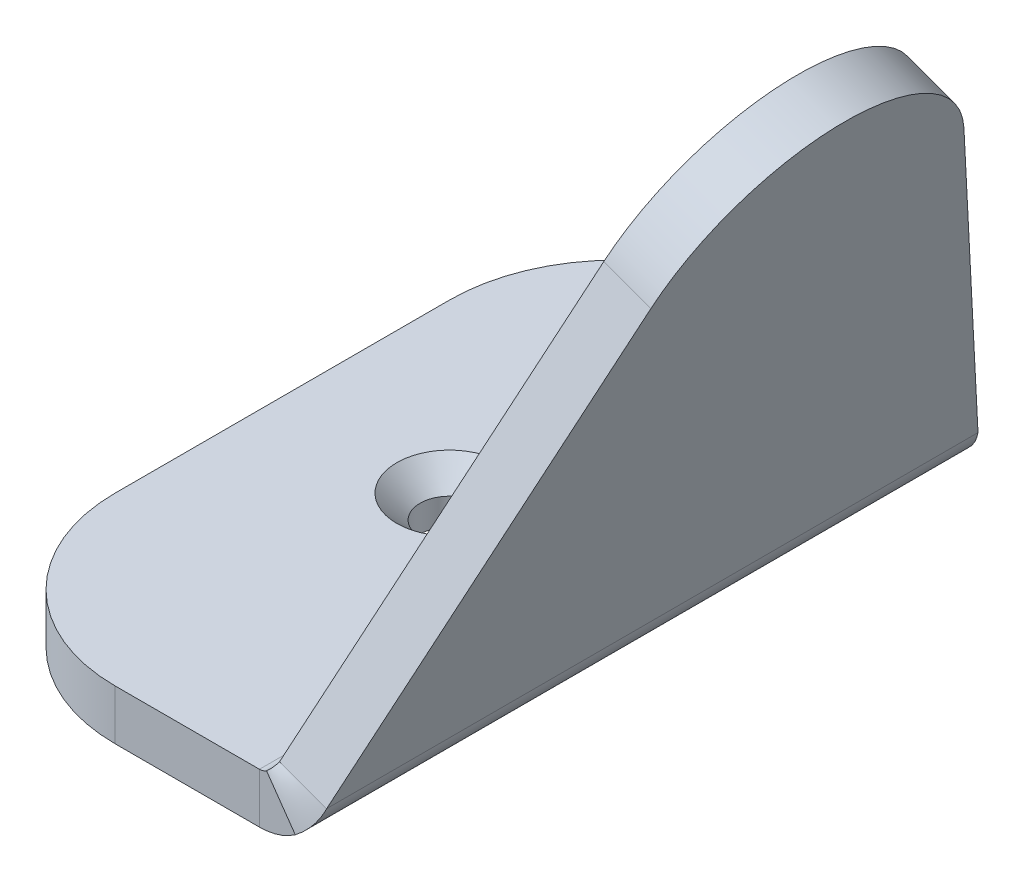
ISO-10303-21;
HEADER;
FILE_DESCRIPTION(('STEP AP214'),'2;1');
FILE_NAME('part.step','',(''),(''),'','','');
FILE_SCHEMA(('AUTOMOTIVE_DESIGN { 1 0 10303 214 1 1 1 1 }'));
ENDSEC;
DATA;
#1=APPLICATION_CONTEXT('core data for automotive mechanical design processes');
#2=APPLICATION_PROTOCOL_DEFINITION('international standard','automotive_design',2000,#1);
#3=PRODUCT_CONTEXT('',#1,'mechanical');
#4=PRODUCT('Part','Part','',(#3));
#5=PRODUCT_RELATED_PRODUCT_CATEGORY('part','',(#4));
#6=PRODUCT_DEFINITION_FORMATION('','',#4);
#7=PRODUCT_DEFINITION_CONTEXT('part definition',#1,'design');
#8=PRODUCT_DEFINITION('design','',#6,#7);
#9=PRODUCT_DEFINITION_SHAPE('','',#8);
#10=(LENGTH_UNIT() NAMED_UNIT(*) SI_UNIT(.MILLI.,.METRE.));
#11=(NAMED_UNIT(*) PLANE_ANGLE_UNIT() SI_UNIT($,.RADIAN.));
#12=(NAMED_UNIT(*) SI_UNIT($,.STERADIAN.) SOLID_ANGLE_UNIT());
#13=UNCERTAINTY_MEASURE_WITH_UNIT(LENGTH_MEASURE(1.E-05),#10,'distance_accuracy_value','');
#14=(GEOMETRIC_REPRESENTATION_CONTEXT(3) GLOBAL_UNCERTAINTY_ASSIGNED_CONTEXT((#13)) GLOBAL_UNIT_ASSIGNED_CONTEXT((#10,
#11,#12)) REPRESENTATION_CONTEXT('',''));
#15=CARTESIAN_POINT('',(0.,0.,0.));
#16=DIRECTION('',(0.,0.,1.));
#17=DIRECTION('',(1.,0.,0.));
#18=AXIS2_PLACEMENT_3D('',#15,#16,#17);
#19=CARTESIAN_POINT('',(8.25750397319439,-11.2221842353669,-10.));
#20=DIRECTION('',(-0.93969262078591,0.342020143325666,0.));
#21=DIRECTION('',(0.,0.,1.));
#22=AXIS2_PLACEMENT_3D('',#19,#20,#21);
#23=PLANE('',#22);
#24=DIRECTION('',(0.320446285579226,0.880418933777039,-0.349537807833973));
#25=VECTOR('',#24,1.);
#26=CARTESIAN_POINT('',(11.6777054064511,-1.82525802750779,20.));
#27=LINE('',#26,#25);
#28=CARTESIAN_POINT('',(12.144994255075,-0.541392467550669,19.4902886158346));
#29=VERTEX_POINT('',#28);
#30=CARTESIAN_POINT('',(21.4236987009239,24.9516384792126,9.36922259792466));
#31=VERTEX_POINT('',#30);
#32=EDGE_CURVE('E109',#29,#31,#27,.T.);
#33=ORIENTED_EDGE('',*,*,#32,.F.);
#34=DIRECTION('',(0.,0.,-1.));
#35=VECTOR('',#34,1.);
#36=CARTESIAN_POINT('',(12.144994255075,-0.541392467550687,-10.));
#37=LINE('',#36,#35);
#38=CARTESIAN_POINT('',(12.1449942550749,-0.541392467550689,-19.4902886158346));
#39=VERTEX_POINT('',#38);
#40=EDGE_CURVE('E100',#29,#39,#37,.T.);
#41=ORIENTED_EDGE('',*,*,#40,.T.);
#42=DIRECTION('',(-0.320446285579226,-0.880418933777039,-0.349537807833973));
#43=VECTOR('',#42,1.);
#44=CARTESIAN_POINT('',(11.6777054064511,-1.82525802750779,-20.));
#45=LINE('',#44,#43);
#46=CARTESIAN_POINT('',(21.4236987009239,24.9516384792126,-9.36922259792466));
#47=VERTEX_POINT('',#46);
#48=EDGE_CURVE('E122',#47,#39,#45,.T.);
#49=ORIENTED_EDGE('',*,*,#48,.F.);
#50=CARTESIAN_POINT('',(20.2282089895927,21.6670574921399,0.));
#51=DIRECTION('',(-0.93969262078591,0.342020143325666,0.));
#52=DIRECTION('',(0.,0.,1.));
#53=AXIS2_PLACEMENT_3D('',#50,#51,#52);
#54=CIRCLE('',#53,10.);
#55=EDGE_CURVE('E99',#31,#47,#54,.T.);
#56=ORIENTED_EDGE('',*,*,#55,.F.);
#57=EDGE_LOOP('',(#33,#41,#49,#56));
#58=FACE_BOUND('',#57,.T.);
#59=ADVANCED_FACE('F54',(#58),#23,.F.);
#60=CARTESIAN_POINT('',(11.6777054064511,-1.82525802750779,-20.));
#61=DIRECTION('',(0.119548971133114,0.328458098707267,-0.936922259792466));
#62=DIRECTION('',(-0.320446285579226,-0.880418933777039,-0.349537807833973));
#63=AXIS2_PLACEMENT_3D('',#60,#61,#62);
#64=PLANE('',#63);
#65=CARTESIAN_POINT('',(9.32591639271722,0.484667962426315,-19.4902886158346));
#66=CARTESIAN_POINT('',(12.1449942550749,-0.54139246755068,-19.4902886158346));
#67=B_SPLINE_CURVE_WITH_KNOTS('',1,(#65,#66),.UNSPECIFIED.,.F.,.F.,(2,2),(0.,1.),.UNSPECIFIED.);
#68=CARTESIAN_POINT('',(9.32591639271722,0.484667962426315,-19.4902886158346));
#69=VERTEX_POINT('',#68);
#70=EDGE_CURVE('E12',#69,#39,#67,.T.);
#71=ORIENTED_EDGE('',*,*,#70,.F.);
#72=DIRECTION('',(-0.320446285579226,-0.880418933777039,-0.349537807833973));
#73=VECTOR('',#72,1.);
#74=CARTESIAN_POINT('',(8.85862754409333,-0.79919759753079,-20.));
#75=LINE('',#74,#73);
#76=CARTESIAN_POINT('',(18.6046208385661,25.9776989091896,-9.36922259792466));
#77=VERTEX_POINT('',#76);
#78=EDGE_CURVE('E105',#77,#69,#75,.T.);
#79=ORIENTED_EDGE('',*,*,#78,.F.);
#80=DIRECTION('',(-0.93969262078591,0.342020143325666,0.));
#81=VECTOR('',#80,1.);
#82=CARTESIAN_POINT('',(21.4236987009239,24.9516384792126,-9.36922259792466));
#83=LINE('',#82,#81);
#84=EDGE_CURVE('E81',#47,#77,#83,.T.);
#85=ORIENTED_EDGE('',*,*,#84,.F.);
#86=ORIENTED_EDGE('',*,*,#48,.T.);
#87=EDGE_LOOP('',(#71,#79,#85,#86));
#88=FACE_BOUND('',#87,.T.);
#89=ADVANCED_FACE('F56',(#88),#64,.T.);
#90=CARTESIAN_POINT('',(20.2282089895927,21.6670574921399,0.));
#91=DIRECTION('',(-0.93969262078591,0.342020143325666,0.));
#92=DIRECTION('',(0.,0.,1.));
#93=AXIS2_PLACEMENT_3D('',#90,#91,#92);
#94=CYLINDRICAL_SURFACE('',#93,10.);
#95=CARTESIAN_POINT('',(17.409131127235,22.693117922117,0.));
#96=DIRECTION('',(-0.93969262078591,0.342020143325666,0.));
#97=DIRECTION('',(0.,0.,1.));
#98=AXIS2_PLACEMENT_3D('',#95,#96,#97);
#99=CIRCLE('',#98,10.);
#100=CARTESIAN_POINT('',(18.6046208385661,25.9776989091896,9.36922259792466));
#101=VERTEX_POINT('',#100);
#102=EDGE_CURVE('E97',#101,#77,#99,.T.);
#103=ORIENTED_EDGE('',*,*,#102,.F.);
#104=DIRECTION('',(-0.93969262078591,0.342020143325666,0.));
#105=VECTOR('',#104,1.);
#106=CARTESIAN_POINT('',(21.4236987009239,24.9516384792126,9.36922259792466));
#107=LINE('',#106,#105);
#108=EDGE_CURVE('E101',#31,#101,#107,.T.);
#109=ORIENTED_EDGE('',*,*,#108,.F.);
#110=ORIENTED_EDGE('',*,*,#55,.T.);
#111=ORIENTED_EDGE('',*,*,#84,.T.);
#112=EDGE_LOOP('',(#103,#109,#110,#111));
#113=FACE_BOUND('',#112,.T.);
#114=ADVANCED_FACE('F94',(#113),#94,.T.);
#115=CARTESIAN_POINT('',(11.6777054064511,-1.82525802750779,20.));
#116=DIRECTION('',(0.119548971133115,0.328458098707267,0.936922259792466));
#117=DIRECTION('',(0.320446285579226,0.880418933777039,-0.349537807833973));
#118=AXIS2_PLACEMENT_3D('',#115,#116,#117);
#119=PLANE('',#118);
#120=CARTESIAN_POINT('',(12.144994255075,-0.541392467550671,19.4902886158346));
#121=CARTESIAN_POINT('',(9.32591639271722,0.484667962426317,19.4902886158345));
#122=B_SPLINE_CURVE_WITH_KNOTS('',1,(#120,#121),.UNSPECIFIED.,.F.,.F.,(2,2),(0.,1.),.UNSPECIFIED.);
#123=CARTESIAN_POINT('',(9.32591639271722,0.484667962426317,19.4902886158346));
#124=VERTEX_POINT('',#123);
#125=EDGE_CURVE('E125',#29,#124,#122,.T.);
#126=ORIENTED_EDGE('',*,*,#125,.F.);
#127=ORIENTED_EDGE('',*,*,#32,.T.);
#128=ORIENTED_EDGE('',*,*,#108,.T.);
#129=DIRECTION('',(0.320446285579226,0.880418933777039,-0.349537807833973));
#130=VECTOR('',#129,1.);
#131=CARTESIAN_POINT('',(8.85862754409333,-0.79919759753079,20.));
#132=LINE('',#131,#130);
#133=EDGE_CURVE('E113',#124,#101,#132,.T.);
#134=ORIENTED_EDGE('',*,*,#133,.F.);
#135=EDGE_LOOP('',(#126,#127,#128,#134));
#136=FACE_BOUND('',#135,.T.);
#137=ADVANCED_FACE('F143',(#136),#119,.T.);
#138=CARTESIAN_POINT('',(5.43842611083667,-10.1961238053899,-10.));
#139=DIRECTION('',(-0.93969262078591,0.342020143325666,0.));
#140=DIRECTION('',(0.,0.,1.));
#141=AXIS2_PLACEMENT_3D('',#138,#139,#140);
#142=PLANE('',#141);
#143=DIRECTION('',(0.,0.,-1.));
#144=VECTOR('',#143,1.);
#145=CARTESIAN_POINT('',(9.32591639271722,0.484667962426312,-10.));
#146=LINE('',#145,#144);
#147=EDGE_CURVE('E65',#124,#69,#146,.T.);
#148=ORIENTED_EDGE('',*,*,#147,.F.);
#149=ORIENTED_EDGE('',*,*,#133,.T.);
#150=ORIENTED_EDGE('',*,*,#102,.T.);
#151=ORIENTED_EDGE('',*,*,#78,.T.);
#152=EDGE_LOOP('',(#148,#149,#150,#151));
#153=FACE_BOUND('',#152,.T.);
#154=ADVANCED_FACE('F111',(#153),#142,.T.);
#155=CARTESIAN_POINT('',(0.,0.,0.));
#156=DIRECTION('',(0.,1.,0.));
#157=DIRECTION('',(0.,0.,1.));
#158=AXIS2_PLACEMENT_3D('',#155,#156,#157);
#159=CONICAL_SURFACE('',#158,3.15,0.785398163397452);
#160=CARTESIAN_POINT('',(0.,-1.4,0.));
#161=DIRECTION('',(0.,1.,0.));
#162=DIRECTION('',(0.,0.,1.));
#163=AXIS2_PLACEMENT_3D('',#160,#161,#162);
#164=CIRCLE('',#163,1.74999999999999);
#165=CARTESIAN_POINT('',(0.,-1.4,1.74999999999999));
#166=VERTEX_POINT('',#165);
#167=EDGE_CURVE('E310',#166,#166,#164,.T.);
#168=ORIENTED_EDGE('',*,*,#167,.F.);
#169=EDGE_LOOP('',(#168));
#170=FACE_BOUND('',#169,.T.);
#171=CARTESIAN_POINT('',(0.,0.,0.));
#172=DIRECTION('',(0.,1.,0.));
#173=DIRECTION('',(0.,0.,1.));
#174=AXIS2_PLACEMENT_3D('',#171,#172,#173);
#175=CIRCLE('',#174,3.15);
#176=CARTESIAN_POINT('',(0.,0.,3.15));
#177=VERTEX_POINT('',#176);
#178=EDGE_CURVE('E307',#177,#177,#175,.T.);
#179=ORIENTED_EDGE('',*,*,#178,.T.);
#180=EDGE_LOOP('',(#179));
#181=FACE_BOUND('',#180,.T.);
#182=ADVANCED_FACE('F154',(#170,#181),#159,.F.);
#183=CARTESIAN_POINT('',(0.,0.,0.));
#184=DIRECTION('',(0.,1.,0.));
#185=DIRECTION('',(0.,0.,1.));
#186=AXIS2_PLACEMENT_3D('',#183,#184,#185);
#187=CYLINDRICAL_SURFACE('',#186,1.74999999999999);
#188=ORIENTED_EDGE('',*,*,#167,.T.);
#189=EDGE_LOOP('',(#188));
#190=FACE_BOUND('',#189,.T.);
#191=CARTESIAN_POINT('',(0.,-3.,0.));
#192=DIRECTION('',(0.,1.,0.));
#193=DIRECTION('',(0.,0.,1.));
#194=AXIS2_PLACEMENT_3D('',#191,#192,#193);
#195=CIRCLE('',#194,1.74999999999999);
#196=CARTESIAN_POINT('',(0.,-3.,1.74999999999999));
#197=VERTEX_POINT('',#196);
#198=EDGE_CURVE('E333',#197,#197,#195,.T.);
#199=ORIENTED_EDGE('',*,*,#198,.F.);
#200=EDGE_LOOP('',(#199));
#201=FACE_BOUND('',#200,.T.);
#202=ADVANCED_FACE('F158',(#190,#201),#187,.F.);
#203=CARTESIAN_POINT('',(0.,-3.,-10.));
#204=DIRECTION('',(0.,1.,0.));
#205=DIRECTION('',(0.,0.,1.));
#206=AXIS2_PLACEMENT_3D('',#203,#204,#205);
#207=CYLINDRICAL_SURFACE('',#206,10.);
#208=CARTESIAN_POINT('',(0.,0.,-10.));
#209=DIRECTION('',(0.,1.,0.));
#210=DIRECTION('',(0.,0.,1.));
#211=AXIS2_PLACEMENT_3D('',#208,#209,#210);
#212=CIRCLE('',#211,10.);
#213=CARTESIAN_POINT('',(0.,0.,-20.));
#214=VERTEX_POINT('',#213);
#215=CARTESIAN_POINT('',(-10.,0.,-10.));
#216=VERTEX_POINT('',#215);
#217=EDGE_CURVE('E351',#214,#216,#212,.T.);
#218=ORIENTED_EDGE('',*,*,#217,.F.);
#219=DIRECTION('',(0.,1.,0.));
#220=VECTOR('',#219,1.);
#221=CARTESIAN_POINT('',(0.,-3.,-20.));
#222=LINE('',#221,#220);
#223=CARTESIAN_POINT('',(0.,-3.,-20.));
#224=VERTEX_POINT('',#223);
#225=EDGE_CURVE('E116',#224,#214,#222,.T.);
#226=ORIENTED_EDGE('',*,*,#225,.F.);
#227=CARTESIAN_POINT('',(0.,-3.,-10.));
#228=DIRECTION('',(0.,1.,0.));
#229=DIRECTION('',(0.,0.,1.));
#230=AXIS2_PLACEMENT_3D('',#227,#228,#229);
#231=CIRCLE('',#230,10.);
#232=CARTESIAN_POINT('',(-10.,-3.,-10.));
#233=VERTEX_POINT('',#232);
#234=EDGE_CURVE('E315',#224,#233,#231,.T.);
#235=ORIENTED_EDGE('',*,*,#234,.T.);
#236=DIRECTION('',(0.,1.,0.));
#237=VECTOR('',#236,1.);
#238=CARTESIAN_POINT('',(-10.,-3.,-10.));
#239=LINE('',#238,#237);
#240=EDGE_CURVE('E318',#233,#216,#239,.T.);
#241=ORIENTED_EDGE('',*,*,#240,.T.);
#242=EDGE_LOOP('',(#218,#226,#235,#241));
#243=FACE_BOUND('',#242,.T.);
#244=ADVANCED_FACE('F443',(#243),#207,.T.);
#245=CARTESIAN_POINT('',(-10.,-3.,-10.));
#246=DIRECTION('',(-1.,0.,0.));
#247=DIRECTION('',(0.,0.,1.));
#248=AXIS2_PLACEMENT_3D('',#245,#246,#247);
#249=PLANE('',#248);
#250=DIRECTION('',(0.,0.,1.));
#251=VECTOR('',#250,1.);
#252=CARTESIAN_POINT('',(-10.,0.,-10.));
#253=LINE('',#252,#251);
#254=CARTESIAN_POINT('',(-10.,0.,10.));
#255=VERTEX_POINT('',#254);
#256=EDGE_CURVE('E354',#216,#255,#253,.T.);
#257=ORIENTED_EDGE('',*,*,#256,.F.);
#258=ORIENTED_EDGE('',*,*,#240,.F.);
#259=DIRECTION('',(0.,0.,1.));
#260=VECTOR('',#259,1.);
#261=CARTESIAN_POINT('',(-10.,-3.,-10.));
#262=LINE('',#261,#260);
#263=CARTESIAN_POINT('',(-10.,-3.,10.));
#264=VERTEX_POINT('',#263);
#265=EDGE_CURVE('E321',#233,#264,#262,.T.);
#266=ORIENTED_EDGE('',*,*,#265,.T.);
#267=DIRECTION('',(0.,1.,0.));
#268=VECTOR('',#267,1.);
#269=CARTESIAN_POINT('',(-10.,-3.,10.));
#270=LINE('',#269,#268);
#271=EDGE_CURVE('E324',#264,#255,#270,.T.);
#272=ORIENTED_EDGE('',*,*,#271,.T.);
#273=EDGE_LOOP('',(#257,#258,#266,#272));
#274=FACE_BOUND('',#273,.T.);
#275=ADVANCED_FACE('F448',(#274),#249,.T.);
#276=CARTESIAN_POINT('',(0.,-3.,10.));
#277=DIRECTION('',(0.,1.,0.));
#278=DIRECTION('',(0.,0.,1.));
#279=AXIS2_PLACEMENT_3D('',#276,#277,#278);
#280=CYLINDRICAL_SURFACE('',#279,10.);
#281=CARTESIAN_POINT('',(0.,0.,10.));
#282=DIRECTION('',(0.,1.,0.));
#283=DIRECTION('',(0.,0.,1.));
#284=AXIS2_PLACEMENT_3D('',#281,#282,#283);
#285=CIRCLE('',#284,10.);
#286=CARTESIAN_POINT('',(0.,0.,20.));
#287=VERTEX_POINT('',#286);
#288=EDGE_CURVE('E357',#255,#287,#285,.T.);
#289=ORIENTED_EDGE('',*,*,#288,.F.);
#290=ORIENTED_EDGE('',*,*,#271,.F.);
#291=CARTESIAN_POINT('',(0.,-3.,10.));
#292=DIRECTION('',(0.,1.,0.));
#293=DIRECTION('',(0.,0.,1.));
#294=AXIS2_PLACEMENT_3D('',#291,#292,#293);
#295=CIRCLE('',#294,10.);
#296=CARTESIAN_POINT('',(0.,-3.,20.));
#297=VERTEX_POINT('',#296);
#298=EDGE_CURVE('E327',#264,#297,#295,.T.);
#299=ORIENTED_EDGE('',*,*,#298,.T.);
#300=DIRECTION('',(0.,1.,0.));
#301=VECTOR('',#300,1.);
#302=CARTESIAN_POINT('',(0.,-3.,20.));
#303=LINE('',#302,#301);
#304=EDGE_CURVE('E330',#297,#287,#303,.T.);
#305=ORIENTED_EDGE('',*,*,#304,.T.);
#306=EDGE_LOOP('',(#289,#290,#299,#305));
#307=FACE_BOUND('',#306,.T.);
#308=ADVANCED_FACE('F462',(#307),#280,.T.);
#309=CARTESIAN_POINT('',(0.,-3.,-10.));
#310=DIRECTION('',(0.,1.,0.));
#311=DIRECTION('',(0.,0.,1.));
#312=AXIS2_PLACEMENT_3D('',#309,#310,#311);
#313=PLANE('',#312);
#314=DIRECTION('',(0.,0.,-1.));
#315=VECTOR('',#314,1.);
#316=CARTESIAN_POINT('',(8.63373880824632,-3.,-10.));
#317=LINE('',#316,#315);
#318=CARTESIAN_POINT('',(8.63373880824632,-3.,20.));
#319=VERTEX_POINT('',#318);
#320=CARTESIAN_POINT('',(8.63373880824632,-3.,-20.));
#321=VERTEX_POINT('',#320);
#322=EDGE_CURVE('E304',#319,#321,#317,.T.);
#323=ORIENTED_EDGE('',*,*,#322,.F.);
#324=DIRECTION('',(1.,0.,0.));
#325=VECTOR('',#324,1.);
#326=CARTESIAN_POINT('',(0.,-3.,20.));
#327=LINE('',#326,#325);
#328=EDGE_CURVE('E336',#297,#319,#327,.T.);
#329=ORIENTED_EDGE('',*,*,#328,.F.);
#330=ORIENTED_EDGE('',*,*,#298,.F.);
#331=ORIENTED_EDGE('',*,*,#265,.F.);
#332=ORIENTED_EDGE('',*,*,#234,.F.);
#333=DIRECTION('',(-1.,0.,0.));
#334=VECTOR('',#333,1.);
#335=CARTESIAN_POINT('',(0.,-3.,-20.));
#336=LINE('',#335,#334);
#337=EDGE_CURVE('E363',#321,#224,#336,.T.);
#338=ORIENTED_EDGE('',*,*,#337,.F.);
#339=EDGE_LOOP('',(#323,#329,#330,#331,#332,#338));
#340=FACE_BOUND('',#339,.T.);
#341=ORIENTED_EDGE('',*,*,#198,.T.);
#342=EDGE_LOOP('',(#341));
#343=FACE_BOUND('',#342,.T.);
#344=ADVANCED_FACE('F457',(#340,#343),#313,.F.);
#345=CARTESIAN_POINT('',(0.,-3.,20.));
#346=DIRECTION('',(0.,0.,1.));
#347=DIRECTION('',(1.,0.,0.));
#348=AXIS2_PLACEMENT_3D('',#345,#346,#347);
#349=PLANE('',#348);
#350=ORIENTED_EDGE('',*,*,#328,.T.);
#351=DIRECTION('',(0.,1.,0.));
#352=VECTOR('',#351,1.);
#353=CARTESIAN_POINT('',(8.63373880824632,-3.,20.));
#354=LINE('',#353,#352);
#355=CARTESIAN_POINT('',(8.63373880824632,0.,20.));
#356=VERTEX_POINT('',#355);
#357=EDGE_CURVE('E339',#319,#356,#354,.T.);
#358=ORIENTED_EDGE('',*,*,#357,.T.);
#359=DIRECTION('',(1.,0.,0.));
#360=VECTOR('',#359,1.);
#361=CARTESIAN_POINT('',(0.,0.,20.));
#362=LINE('',#361,#360);
#363=EDGE_CURVE('E342',#287,#356,#362,.T.);
#364=ORIENTED_EDGE('',*,*,#363,.F.);
#365=ORIENTED_EDGE('',*,*,#304,.F.);
#366=EDGE_LOOP('',(#350,#358,#364,#365));
#367=FACE_BOUND('',#366,.T.);
#368=ADVANCED_FACE('F465',(#367),#349,.T.);
#369=CARTESIAN_POINT('',(0.,0.,-10.));
#370=DIRECTION('',(0.,1.,0.));
#371=DIRECTION('',(0.,0.,1.));
#372=AXIS2_PLACEMENT_3D('',#369,#370,#371);
#373=PLANE('',#372);
#374=ORIENTED_EDGE('',*,*,#178,.F.);
#375=EDGE_LOOP('',(#374));
#376=FACE_BOUND('',#375,.T.);
#377=ORIENTED_EDGE('',*,*,#363,.T.);
#378=DIRECTION('',(0.,0.,-1.));
#379=VECTOR('',#378,1.);
#380=CARTESIAN_POINT('',(8.63373880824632,0.,-10.));
#381=LINE('',#380,#379);
#382=CARTESIAN_POINT('',(8.63373880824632,0.,-20.));
#383=VERTEX_POINT('',#382);
#384=EDGE_CURVE('E345',#356,#383,#381,.T.);
#385=ORIENTED_EDGE('',*,*,#384,.T.);
#386=DIRECTION('',(-1.,0.,0.));
#387=VECTOR('',#386,1.);
#388=CARTESIAN_POINT('',(0.,0.,-20.));
#389=LINE('',#388,#387);
#390=EDGE_CURVE('E348',#383,#214,#389,.T.);
#391=ORIENTED_EDGE('',*,*,#390,.T.);
#392=ORIENTED_EDGE('',*,*,#217,.T.);
#393=ORIENTED_EDGE('',*,*,#256,.T.);
#394=ORIENTED_EDGE('',*,*,#288,.T.);
#395=EDGE_LOOP('',(#377,#385,#391,#392,#393,#394));
#396=FACE_BOUND('',#395,.T.);
#397=ADVANCED_FACE('F451',(#376,#396),#373,.T.);
#398=CARTESIAN_POINT('',(0.,-3.,-20.));
#399=DIRECTION('',(0.,0.,-1.));
#400=DIRECTION('',(-1.,0.,0.));
#401=AXIS2_PLACEMENT_3D('',#398,#399,#400);
#402=PLANE('',#401);
#403=ORIENTED_EDGE('',*,*,#390,.F.);
#404=DIRECTION('',(0.,-1.,0.));
#405=VECTOR('',#404,1.);
#406=CARTESIAN_POINT('',(8.63373880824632,-3.,-20.));
#407=LINE('',#406,#405);
#408=EDGE_CURVE('E360',#383,#321,#407,.T.);
#409=ORIENTED_EDGE('',*,*,#408,.T.);
#410=ORIENTED_EDGE('',*,*,#337,.T.);
#411=ORIENTED_EDGE('',*,*,#225,.T.);
#412=EDGE_LOOP('',(#403,#409,#410,#411));
#413=FACE_BOUND('',#412,.T.);
#414=ADVANCED_FACE('F454',(#413),#402,.T.);
#415=CARTESIAN_POINT('',(8.63373880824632,0.7366,20.));
#416=DIRECTION('',(0.,0.,1.));
#417=DIRECTION('',(1.,0.,0.));
#418=AXIS2_PLACEMENT_3D('',#415,#416,#417);
#419=PLANE('',#418);
#420=CARTESIAN_POINT('',(9.0562352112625,0.133212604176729,20.));
#421=CARTESIAN_POINT('',(10.7769645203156,-2.32424352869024,20.));
#422=B_SPLINE_CURVE_WITH_KNOTS('',1,(#420,#421),.UNSPECIFIED.,.F.,.F.,(2,2),(0.,1.),.UNSPECIFIED.);
#423=CARTESIAN_POINT('',(9.0562352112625,0.133212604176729,20.));
#424=VERTEX_POINT('',#423);
#425=CARTESIAN_POINT('',(10.7769645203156,-2.32424352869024,20.));
#426=VERTEX_POINT('',#425);
#427=EDGE_CURVE('E301',#424,#426,#422,.T.);
#428=ORIENTED_EDGE('',*,*,#427,.F.);
#429=CARTESIAN_POINT('',(8.63373880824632,0.7366,20.));
#430=DIRECTION('',(0.,0.,1.));
#431=DIRECTION('',(1.,0.,0.));
#432=AXIS2_PLACEMENT_3D('',#429,#430,#431);
#433=CIRCLE('',#432,0.7366);
#434=EDGE_CURVE('E203',#424,#356,#433,.F.);
#435=ORIENTED_EDGE('',*,*,#434,.T.);
#436=ORIENTED_EDGE('',*,*,#357,.F.);
#437=CARTESIAN_POINT('',(8.63373880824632,0.7366,20.));
#438=DIRECTION('',(0.,0.,-1.));
#439=DIRECTION('',(1.,0.,0.));
#440=AXIS2_PLACEMENT_3D('',#437,#438,#439);
#441=CIRCLE('',#440,3.7366);
#442=EDGE_CURVE('E204',#426,#319,#441,.T.);
#443=ORIENTED_EDGE('',*,*,#442,.F.);
#444=EDGE_LOOP('',(#428,#435,#436,#443));
#445=FACE_BOUND('',#444,.T.);
#446=ADVANCED_FACE('F380',(#445),#419,.T.);
#447=CARTESIAN_POINT('',(8.63373880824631,0.7366,-20.));
#448=DIRECTION('',(0.,0.,-1.));
#449=DIRECTION('',(0.,1.,0.));
#450=AXIS2_PLACEMENT_3D('',#447,#448,#449);
#451=PLANE('',#450);
#452=ORIENTED_EDGE('',*,*,#408,.F.);
#453=CARTESIAN_POINT('',(8.63373880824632,0.7366,-20.));
#454=DIRECTION('',(0.,0.,1.));
#455=DIRECTION('',(1.,0.,0.));
#456=AXIS2_PLACEMENT_3D('',#453,#454,#455);
#457=CIRCLE('',#456,0.7366);
#458=CARTESIAN_POINT('',(9.0562352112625,0.133212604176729,-20.));
#459=VERTEX_POINT('',#458);
#460=EDGE_CURVE('E236',#383,#459,#457,.T.);
#461=ORIENTED_EDGE('',*,*,#460,.T.);
#462=CARTESIAN_POINT('',(10.7769645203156,-2.32424352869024,-20.));
#463=CARTESIAN_POINT('',(9.0562352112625,0.13321260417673,-20.));
#464=B_SPLINE_CURVE_WITH_KNOTS('',1,(#462,#463),.UNSPECIFIED.,.F.,.F.,(2,2),(0.,1.),.UNSPECIFIED.);
#465=CARTESIAN_POINT('',(10.7769645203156,-2.32424352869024,-20.));
#466=VERTEX_POINT('',#465);
#467=EDGE_CURVE('E298',#459,#466,#464,.F.);
#468=ORIENTED_EDGE('',*,*,#467,.T.);
#469=CARTESIAN_POINT('',(8.63373880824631,0.7366,-20.));
#470=DIRECTION('',(0.,0.,1.));
#471=DIRECTION('',(0.,1.,0.));
#472=AXIS2_PLACEMENT_3D('',#469,#470,#471);
#473=CIRCLE('',#472,3.7366);
#474=EDGE_CURVE('E271',#321,#466,#473,.T.);
#475=ORIENTED_EDGE('',*,*,#474,.F.);
#476=EDGE_LOOP('',(#452,#461,#468,#475));
#477=FACE_BOUND('',#476,.T.);
#478=ADVANCED_FACE('F474',(#477),#451,.T.);
#479=CARTESIAN_POINT('',(10.7769645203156,-2.32424352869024,-20.));
#480=CARTESIAN_POINT('',(11.401854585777,-1.88669079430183,-19.8296502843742));
#481=CARTESIAN_POINT('',(11.8840842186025,-1.25823690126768,-19.6606383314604));
#482=CARTESIAN_POINT('',(12.1449942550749,-0.54139246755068,-19.4902886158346));
#483=CARTESIAN_POINT('',(9.0562352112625,0.13321260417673,-20.));
#484=CARTESIAN_POINT('',(9.17927987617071,0.219369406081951,-19.8298447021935));
#485=CARTESIAN_POINT('',(9.274541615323,0.343516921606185,-19.6604439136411));
#486=CARTESIAN_POINT('',(9.32591639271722,0.484667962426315,-19.4902886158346));
#487=B_SPLINE_SURFACE_WITH_KNOTS('',1,3,((#479,#480,#481,#482),(#483,#484,#485,#486)),
.UNSPECIFIED.,.F.,.F.,.F.,(2,2),(4,4),(0.,1.),(0.,1.),.UNSPECIFIED.);
#488=CARTESIAN_POINT('',(9.0562352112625,0.13321260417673,-20.));
#489=CARTESIAN_POINT('',(9.17927987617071,0.219369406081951,-19.8298447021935));
#490=CARTESIAN_POINT('',(9.274541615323,0.343516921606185,-19.6604439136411));
#491=CARTESIAN_POINT('',(9.32591639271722,0.484667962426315,-19.4902886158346));
#492=B_SPLINE_CURVE_WITH_KNOTS('',3,(#488,#489,#490,#491),.UNSPECIFIED.,.F.,.F.,(4,4),(0.,1.),.UNSPECIFIED.);
#493=EDGE_CURVE('E205',#459,#69,#492,.T.);
#494=CARTESIAN_POINT('',(12.1449942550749,-0.54139246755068,-19.4902886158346));
#495=CARTESIAN_POINT('',(11.8840842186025,-1.25823690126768,-19.6606383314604));
#496=CARTESIAN_POINT('',(11.401854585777,-1.88669079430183,-19.8296502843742));
#497=CARTESIAN_POINT('',(10.7769645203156,-2.32424352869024,-20.));
#498=B_SPLINE_CURVE_WITH_KNOTS('',3,(#494,#495,#496,#497),.UNSPECIFIED.,.F.,.F.,(4,4),(0.,1.),.UNSPECIFIED.);
#499=EDGE_CURVE('E72',#466,#39,#498,.F.);
#500=ORIENTED_EDGE('',*,*,#467,.F.);
#501=ORIENTED_EDGE('',*,*,#493,.T.);
#502=ORIENTED_EDGE('',*,*,#70,.T.);
#503=ORIENTED_EDGE('',*,*,#499,.F.);
#504=EDGE_LOOP('',(#500,#501,#502,#503));
#505=FACE_BOUND('',#504,.T.);
#506=ADVANCED_FACE('F224',(#505),#487,.T.);
#507=CARTESIAN_POINT('',(12.144994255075,-0.541392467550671,19.4902886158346));
#508=CARTESIAN_POINT('',(11.8840842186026,-1.25823690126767,19.6606383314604));
#509=CARTESIAN_POINT('',(11.401854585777,-1.88669079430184,19.8296502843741));
#510=CARTESIAN_POINT('',(10.7769645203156,-2.32424352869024,20.));
#511=CARTESIAN_POINT('',(9.32591639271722,0.484667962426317,19.4902886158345));
#512=CARTESIAN_POINT('',(9.274541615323,0.343516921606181,19.6604439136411));
#513=CARTESIAN_POINT('',(9.17927987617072,0.219369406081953,19.8298447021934));
#514=CARTESIAN_POINT('',(9.0562352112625,0.133212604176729,20.));
#515=B_SPLINE_SURFACE_WITH_KNOTS('',1,3,((#507,#508,#509,#510),(#511,#512,#513,#514)),
.UNSPECIFIED.,.F.,.F.,.F.,(2,2),(4,4),(0.,1.),(0.,1.),.UNSPECIFIED.);
#516=CARTESIAN_POINT('',(9.32591639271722,0.484667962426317,19.4902886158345));
#517=CARTESIAN_POINT('',(9.274541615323,0.343516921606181,19.6604439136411));
#518=CARTESIAN_POINT('',(9.17927987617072,0.219369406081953,19.8298447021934));
#519=CARTESIAN_POINT('',(9.0562352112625,0.133212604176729,20.));
#520=B_SPLINE_CURVE_WITH_KNOTS('',3,(#516,#517,#518,#519),.UNSPECIFIED.,.F.,.F.,(4,4),(0.,1.),.UNSPECIFIED.);
#521=EDGE_CURVE('E191',#124,#424,#520,.T.);
#522=CARTESIAN_POINT('',(10.7769645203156,-2.32424352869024,20.));
#523=CARTESIAN_POINT('',(11.401854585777,-1.88669079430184,19.8296502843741));
#524=CARTESIAN_POINT('',(11.8840842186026,-1.25823690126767,19.6606383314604));
#525=CARTESIAN_POINT('',(12.144994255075,-0.541392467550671,19.4902886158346));
#526=B_SPLINE_CURVE_WITH_KNOTS('',3,(#522,#523,#524,#525),.UNSPECIFIED.,.F.,.F.,(4,4),(0.,1.),.UNSPECIFIED.);
#527=EDGE_CURVE('E194',#29,#426,#526,.F.);
#528=ORIENTED_EDGE('',*,*,#521,.T.);
#529=ORIENTED_EDGE('',*,*,#427,.T.);
#530=ORIENTED_EDGE('',*,*,#527,.F.);
#531=ORIENTED_EDGE('',*,*,#125,.T.);
#532=EDGE_LOOP('',(#528,#529,#530,#531));
#533=FACE_BOUND('',#532,.T.);
#534=ADVANCED_FACE('F188',(#533),#515,.T.);
#535=CARTESIAN_POINT('',(8.63373880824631,0.7366,-40.2053065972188));
#536=DIRECTION('',(0.,0.,1.));
#537=DIRECTION('',(1.,0.,0.));
#538=AXIS2_PLACEMENT_3D('',#535,#536,#537);
#539=CYLINDRICAL_SURFACE('',#538,3.7366);
#540=ORIENTED_EDGE('',*,*,#40,.F.);
#541=ORIENTED_EDGE('',*,*,#527,.T.);
#542=ORIENTED_EDGE('',*,*,#442,.T.);
#543=ORIENTED_EDGE('',*,*,#322,.T.);
#544=ORIENTED_EDGE('',*,*,#474,.T.);
#545=ORIENTED_EDGE('',*,*,#499,.T.);
#546=EDGE_LOOP('',(#540,#541,#542,#543,#544,#545));
#547=FACE_BOUND('',#546,.T.);
#548=ADVANCED_FACE('F222',(#547),#539,.T.);
#549=CARTESIAN_POINT('',(8.63373880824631,0.7366,-40.2053065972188));
#550=DIRECTION('',(0.,0.,1.));
#551=DIRECTION('',(1.,0.,0.));
#552=AXIS2_PLACEMENT_3D('',#549,#550,#551);
#553=CYLINDRICAL_SURFACE('',#552,0.7366);
#554=ORIENTED_EDGE('',*,*,#147,.T.);
#555=ORIENTED_EDGE('',*,*,#493,.F.);
#556=ORIENTED_EDGE('',*,*,#460,.F.);
#557=ORIENTED_EDGE('',*,*,#384,.F.);
#558=ORIENTED_EDGE('',*,*,#434,.F.);
#559=ORIENTED_EDGE('',*,*,#521,.F.);
#560=EDGE_LOOP('',(#554,#555,#556,#557,#558,#559));
#561=FACE_BOUND('',#560,.T.);
#562=ADVANCED_FACE('F200',(#561),#553,.F.);
#563=CLOSED_SHELL('',(#59,#89,#114,#137,#154,#182,#202,#244,#275,#308,#344,#368,#397,#414,#446,
#478,#506,#534,#548,#562));
#564=MANIFOLD_SOLID_BREP('B2',#563);
#565=ADVANCED_BREP_SHAPE_REPRESENTATION('',(#18,#564),#14);
#566=SHAPE_DEFINITION_REPRESENTATION(#9,#565);
ENDSEC;
END-ISO-10303-21;
